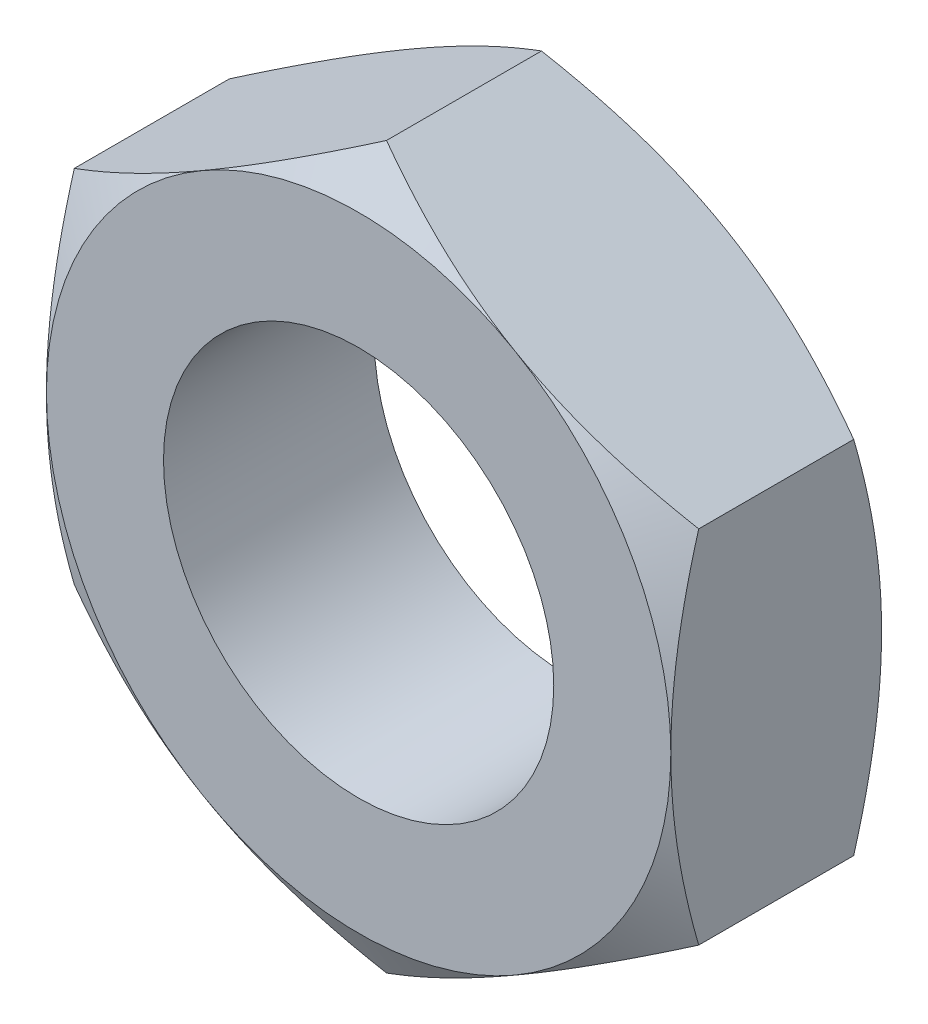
from build123d import *

# Parameters (mm, degrees)
BASE_EXTRUSION_DEPTH    = 2.7
ESQUISSE3_R             = 2.5
ENL_V_MAT_EXTRU_1_DEPTH = 7.68006986


with BuildPart() as part:
    # Esquisse1 → Base-Extrusion (new body)
    with BuildSketch(Plane.XY):
        Polygon((4, -2.309401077), (4, 2.309401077), (0, 4.618802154), (-4, 2.309401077), (-4, -2.309401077), (0, -4.618802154), align=None)
    extrude(amount=-BASE_EXTRUSION_DEPTH)

    # Esquisse2 → Enl_vement de mati_re-R_volution1 (revolve, cut)
    with BuildSketch(Plane(origin=(0, 0, 0), x_dir=(1, 0, 0), z_dir=(0, 1, 0)), mode=Mode.PRIVATE) as enl_vement_de_mati_re_r_volution1_sk:
        Polygon((-4, 0), (-7.33826859, 0), (-7.33826859, 2.7), (-4, 2.7), (-6.33826859, 1.35), align=None)
    revolve(enl_vement_de_mati_re_r_volution1_sk.sketch.rotate(Axis((0, 0, -2.7), (0, 0, 1)), 180), axis=Axis((0, 0, -2.7), (0, 0, 1)), mode=Mode.SUBTRACT)

    # Esquisse3 → Enl_v. mat.-Extru.1 (cut, through all)
    with BuildSketch(Plane.XY):
        Circle(ESQUISSE3_R)
    extrude(amount=-ENL_V_MAT_EXTRU_1_DEPTH, mode=Mode.SUBTRACT)


solid = part.part
